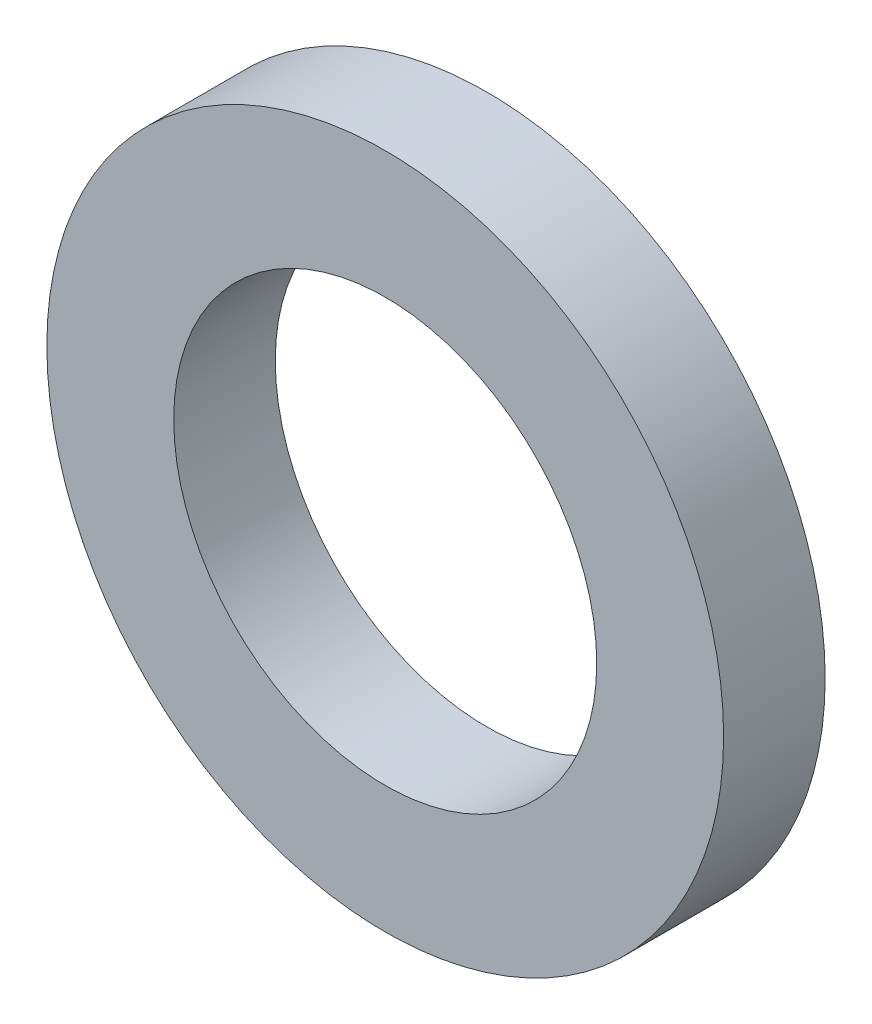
ISO-10303-21;
HEADER;
FILE_DESCRIPTION(('STEP AP214'),'2;1');
FILE_NAME('part.step','',(''),(''),'','','');
FILE_SCHEMA(('AUTOMOTIVE_DESIGN { 1 0 10303 214 1 1 1 1 }'));
ENDSEC;
DATA;
#1=APPLICATION_CONTEXT('core data for automotive mechanical design processes');
#2=APPLICATION_PROTOCOL_DEFINITION('international standard','automotive_design',2000,#1);
#3=PRODUCT_CONTEXT('',#1,'mechanical');
#4=PRODUCT('Part','Part','',(#3));
#5=PRODUCT_RELATED_PRODUCT_CATEGORY('part','',(#4));
#6=PRODUCT_DEFINITION_FORMATION('','',#4);
#7=PRODUCT_DEFINITION_CONTEXT('part definition',#1,'design');
#8=PRODUCT_DEFINITION('design','',#6,#7);
#9=PRODUCT_DEFINITION_SHAPE('','',#8);
#10=(LENGTH_UNIT() NAMED_UNIT(*) SI_UNIT(.MILLI.,.METRE.));
#11=(NAMED_UNIT(*) PLANE_ANGLE_UNIT() SI_UNIT($,.RADIAN.));
#12=(NAMED_UNIT(*) SI_UNIT($,.STERADIAN.) SOLID_ANGLE_UNIT());
#13=UNCERTAINTY_MEASURE_WITH_UNIT(LENGTH_MEASURE(1.E-05),#10,'distance_accuracy_value','');
#14=(GEOMETRIC_REPRESENTATION_CONTEXT(3) GLOBAL_UNCERTAINTY_ASSIGNED_CONTEXT((#13)) GLOBAL_UNIT_ASSIGNED_CONTEXT((#10,
#11,#12)) REPRESENTATION_CONTEXT('',''));
#15=CARTESIAN_POINT('',(0.,0.,0.));
#16=DIRECTION('',(0.,0.,1.));
#17=DIRECTION('',(1.,0.,0.));
#18=AXIS2_PLACEMENT_3D('',#15,#16,#17);
#19=CARTESIAN_POINT('',(0.,0.,1.2));
#20=DIRECTION('',(0.,0.,1.));
#21=DIRECTION('',(1.,0.,0.));
#22=AXIS2_PLACEMENT_3D('',#19,#20,#21);
#23=PLANE('',#22);
#24=CARTESIAN_POINT('',(0.,0.,1.2));
#25=DIRECTION('',(0.,0.,1.));
#26=DIRECTION('',(1.,0.,0.));
#27=AXIS2_PLACEMENT_3D('',#24,#25,#26);
#28=CIRCLE('',#27,4.);
#29=CARTESIAN_POINT('',(4.,0.,1.2));
#30=VERTEX_POINT('',#29);
#31=EDGE_CURVE('E10',#30,#30,#28,.T.);
#32=ORIENTED_EDGE('',*,*,#31,.T.);
#33=EDGE_LOOP('',(#32));
#34=FACE_BOUND('',#33,.T.);
#35=CARTESIAN_POINT('',(0.,0.,1.2));
#36=DIRECTION('',(0.,0.,1.));
#37=DIRECTION('',(1.,0.,0.));
#38=AXIS2_PLACEMENT_3D('',#35,#36,#37);
#39=CIRCLE('',#38,2.5);
#40=CARTESIAN_POINT('',(2.5,0.,1.2));
#41=VERTEX_POINT('',#40);
#42=EDGE_CURVE('E44',#41,#41,#39,.T.);
#43=ORIENTED_EDGE('',*,*,#42,.F.);
#44=EDGE_LOOP('',(#43));
#45=FACE_BOUND('',#44,.T.);
#46=ADVANCED_FACE('F33',(#34,#45),#23,.T.);
#47=CARTESIAN_POINT('',(0.,0.,0.));
#48=DIRECTION('',(0.,0.,1.));
#49=DIRECTION('',(1.,0.,0.));
#50=AXIS2_PLACEMENT_3D('',#47,#48,#49);
#51=PLANE('',#50);
#52=CARTESIAN_POINT('',(0.,0.,0.));
#53=DIRECTION('',(0.,0.,1.));
#54=DIRECTION('',(1.,0.,0.));
#55=AXIS2_PLACEMENT_3D('',#52,#53,#54);
#56=CIRCLE('',#55,4.);
#57=CARTESIAN_POINT('',(4.,0.,0.));
#58=VERTEX_POINT('',#57);
#59=EDGE_CURVE('E37',#58,#58,#56,.T.);
#60=ORIENTED_EDGE('',*,*,#59,.F.);
#61=EDGE_LOOP('',(#60));
#62=FACE_BOUND('',#61,.T.);
#63=CARTESIAN_POINT('',(0.,0.,0.));
#64=DIRECTION('',(0.,0.,1.));
#65=DIRECTION('',(1.,0.,0.));
#66=AXIS2_PLACEMENT_3D('',#63,#64,#65);
#67=CIRCLE('',#66,2.5);
#68=CARTESIAN_POINT('',(2.5,0.,0.));
#69=VERTEX_POINT('',#68);
#70=EDGE_CURVE('E46',#69,#69,#67,.T.);
#71=ORIENTED_EDGE('',*,*,#70,.T.);
#72=EDGE_LOOP('',(#71));
#73=FACE_BOUND('',#72,.T.);
#74=ADVANCED_FACE('F56',(#62,#73),#51,.F.);
#75=CARTESIAN_POINT('',(0.,0.,1.2));
#76=DIRECTION('',(0.,0.,-1.));
#77=DIRECTION('',(-1.,0.,0.));
#78=AXIS2_PLACEMENT_3D('',#75,#76,#77);
#79=CYLINDRICAL_SURFACE('',#78,4.);
#80=ORIENTED_EDGE('',*,*,#31,.F.);
#81=EDGE_LOOP('',(#80));
#82=FACE_BOUND('',#81,.T.);
#83=ORIENTED_EDGE('',*,*,#59,.T.);
#84=EDGE_LOOP('',(#83));
#85=FACE_BOUND('',#84,.T.);
#86=ADVANCED_FACE('F35',(#82,#85),#79,.T.);
#87=CARTESIAN_POINT('',(0.,0.,1.2));
#88=DIRECTION('',(0.,0.,-1.));
#89=DIRECTION('',(-1.,0.,0.));
#90=AXIS2_PLACEMENT_3D('',#87,#88,#89);
#91=CYLINDRICAL_SURFACE('',#90,2.5);
#92=ORIENTED_EDGE('',*,*,#42,.T.);
#93=EDGE_LOOP('',(#92));
#94=FACE_BOUND('',#93,.T.);
#95=ORIENTED_EDGE('',*,*,#70,.F.);
#96=EDGE_LOOP('',(#95));
#97=FACE_BOUND('',#96,.T.);
#98=ADVANCED_FACE('F52',(#94,#97),#91,.F.);
#99=CLOSED_SHELL('',(#46,#74,#86,#98));
#100=MANIFOLD_SOLID_BREP('B2',#99);
#101=ADVANCED_BREP_SHAPE_REPRESENTATION('',(#18,#100),#14);
#102=SHAPE_DEFINITION_REPRESENTATION(#9,#101);
ENDSEC;
END-ISO-10303-21;
